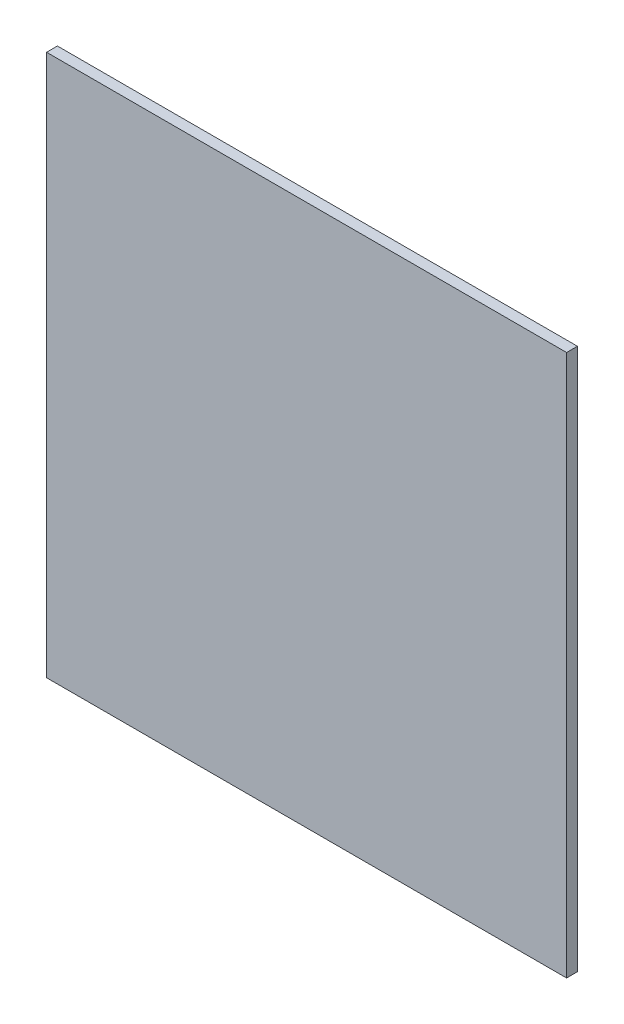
from build123d import *

# Parameters (mm, degrees)
SKETCH1_W            = 317.5
SKETCH1_H            = 6.35
PANEL_OR_BLOCK_DEPTH = 304.8


with BuildPart() as part:
    # Sketch1 → Panel_or_block (new body)
    with BuildSketch(Plane.YZ):
        with Locations((0, -155.575)):
            Rectangle(SKETCH1_W, SKETCH1_H)
    extrude(amount=PANEL_OR_BLOCK_DEPTH)


solid = part.part
